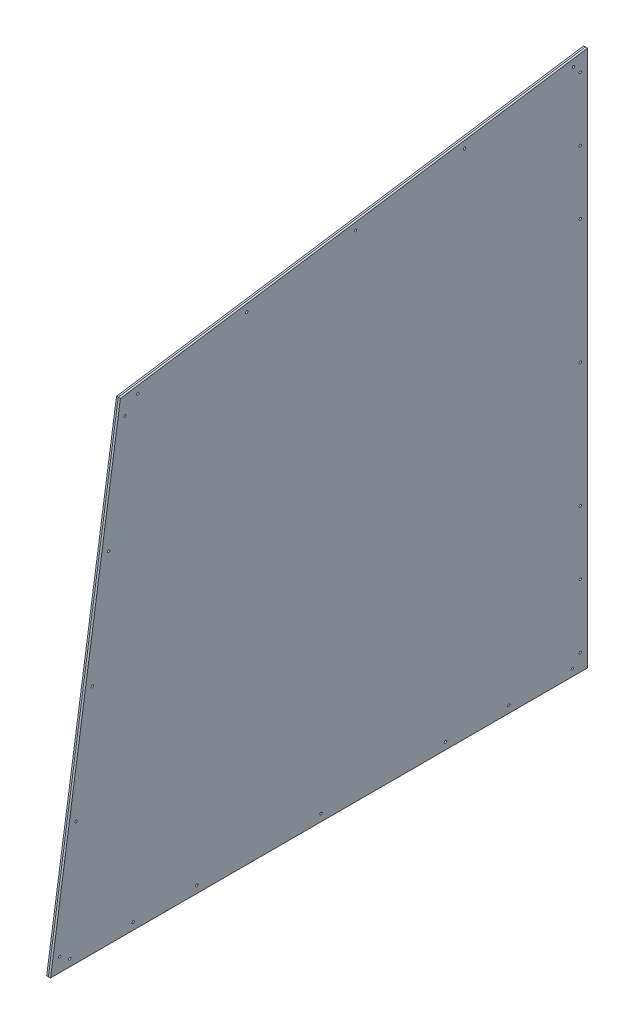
from build123d import *

# Parameters (mm, degrees)
BOSS_EXTRUDE1_DEPTH = 4.365625
CUT_EXTRUDE1_DEPTH  = 1731.267683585
CUT_EXTRUDE2_DEPTH  = 1731.267683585
SKETCH5_R           = 2.57937
CUT_EXTRUDE3_DEPTH  = 1715.327857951


with BuildPart() as part:
    # Sketch2 → Boss-Extrude1 (new, symmetric)
    with BuildSketch(Plane(origin=(0, 0, 0), x_dir=(0, 0, -1), z_dir=(1, 0, 0))):
        Polygon((-4.365625, 1212.197131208), (-1055.067217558, 1055.067217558), (-1212.197131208, 4.365625), (-4.365625, 4.365625), align=None)
    extrude(amount=BOSS_EXTRUDE1_DEPTH, both=True)

    # Sketch3 → Cut-Extrude1 (cut, through all, along a direction that is not the sketch's normal)
    with BuildSketch(Plane.XZ.offset(-4.365625)):
        Polygon((0, 1212.197131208), (4.365625, 1211.544262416), (4.365625, 1214.737131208), (-4.365625, 1214.737131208), (-4.365625, 1211.544262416), align=None)
    extrude(amount=-CUT_EXTRUDE1_DEPTH, dir=(0, -0.9890018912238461, 0.14790287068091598), mode=Mode.SUBTRACT)

    # Sketch4 → Cut-Extrude2 (cut, through all, along a direction that is not the sketch's normal)
    with BuildSketch(Plane(origin=(0, 0, 4.365625), x_dir=(-1, 0, 0), z_dir=(0, 0, -1))):
        Polygon((0, 1212.197131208), (-4.365625, 1211.544262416), (-4.365625, 1214.737131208), (4.365625, 1214.737131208), (4.365625, 1211.544262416), align=None)
    extrude(amount=-CUT_EXTRUDE2_DEPTH, dir=(0, 0.14790287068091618, -0.9890018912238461), mode=Mode.SUBTRACT)

    # Sketch5 → Cut-Extrude3 (cut, through all)
    with BuildSketch(Plane(origin=(4.365625, 0, 0), x_dir=(0, 0, -1), z_dir=(1, 0, 0))):
        with Locations((-525.52918334, 1117.502273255)):
            Circle(SKETCH5_R)
        with Locations((-770.455501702, 1080.87412733)):
            Circle(SKETCH5_R)
        with Locations((-1015.381820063, 1044.245981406)):
            Circle(SKETCH5_R)
        with Locations((-1044.283729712, 1015.126611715)):
            Circle(SKETCH5_R)
        with Locations((-1080.911875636, 770.200293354)):
            Circle(SKETCH5_R)
        with Locations((-1117.54002156, 525.273974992)):
            Circle(SKETCH5_R)
        with Locations((-1154.168167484, 280.347656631)):
            Circle(SKETCH5_R)
        with Locations((-1190.796313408, 35.421338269)):
            Circle(SKETCH5_R)
        with Locations((-1168.4, 20.240625)):
            Circle(SKETCH5_R)
        with Locations((-1025.525, 20.240625)):
            Circle(SKETCH5_R)
        with Locations((-882.65, 20.240625)):
            Circle(SKETCH5_R)
        with Locations((-603.25, 20.240625)):
            Circle(SKETCH5_R)
        with Locations((-323.85, 20.240625)):
            Circle(SKETCH5_R)
        with Locations((-180.975, 20.240625)):
            Circle(SKETCH5_R)
        with Locations((-38.1, 20.240625)):
            Circle(SKETCH5_R)
        with Locations((-20.240625, 42.465625)):
            Circle(SKETCH5_R)
        with Locations((-20.240625, 185.340625)):
            Circle(SKETCH5_R)
        with Locations((-20.240625, 328.215625)):
            Circle(SKETCH5_R)
        with Locations((-20.240625, 607.615625)):
            Circle(SKETCH5_R)
        with Locations((-20.240625, 887.015625)):
            Circle(SKETCH5_R)
        with Locations((-20.240625, 1029.890625)):
            Circle(SKETCH5_R)
        with Locations((-20.240625, 1172.765625)):
            Circle(SKETCH5_R)
        with Locations((-35.676546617, 1190.758565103)):
            Circle(SKETCH5_R)
        with Locations((-280.602864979, 1154.130419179)):
            Circle(SKETCH5_R)
    extrude(amount=-CUT_EXTRUDE3_DEPTH, mode=Mode.SUBTRACT)


solid = part.part
